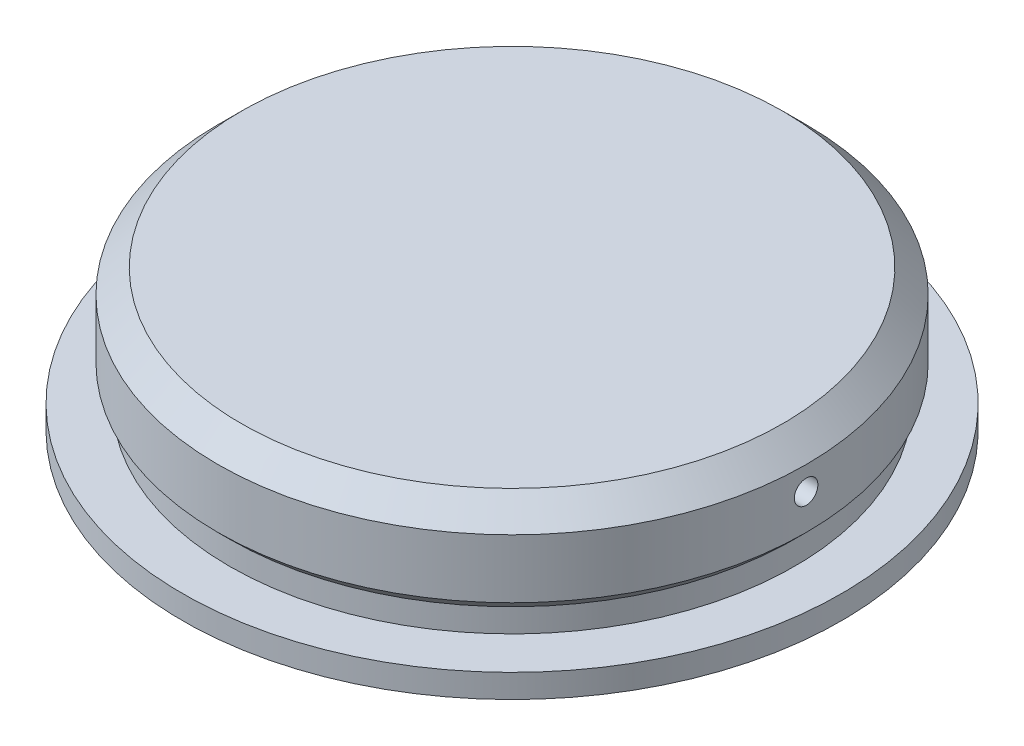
from build123d import *

# Parameters (mm, degrees)
CUT_EXTRUDE_2_DEPTH      = 15
CUT_EXTRUDE_2_DEPTH_BACK = 15
SKETCH_3_R               = 0.5


with BuildPart() as part:
    # Sketch 1 → Revolve 1 (revolve)
    with BuildSketch(Plane.XY, mode=Mode.PRIVATE) as revolve_1_sk:
        Polygon((0, 0), (14, 0), (14, 1), (12, 1), (12, 2), (12.5, 2.5), (12.5, 5), (11.5, 6), (0, 6), align=None)
    revolve(revolve_1_sk.sketch.rotate(Axis((0, 0, 0), (0, 1, 0)), 90), axis=Axis((0, 0, 0), (0, 1, 0)))

    # Sketch 3 → Cut-Extrude 2 (cut, two sides: drawn at the far end of the back side and taken through both)
    with BuildSketch(Plane(origin=(0, 0, 0), x_dir=(0, 0, -1), z_dir=(1, 0, 0)).offset(-CUT_EXTRUDE_2_DEPTH_BACK)):
        with Locations(Location((0, 4, 0), (0, 0, 180))):
            Circle(SKETCH_3_R)
    extrude(amount=CUT_EXTRUDE_2_DEPTH + CUT_EXTRUDE_2_DEPTH_BACK, mode=Mode.SUBTRACT)


solid = part.part
